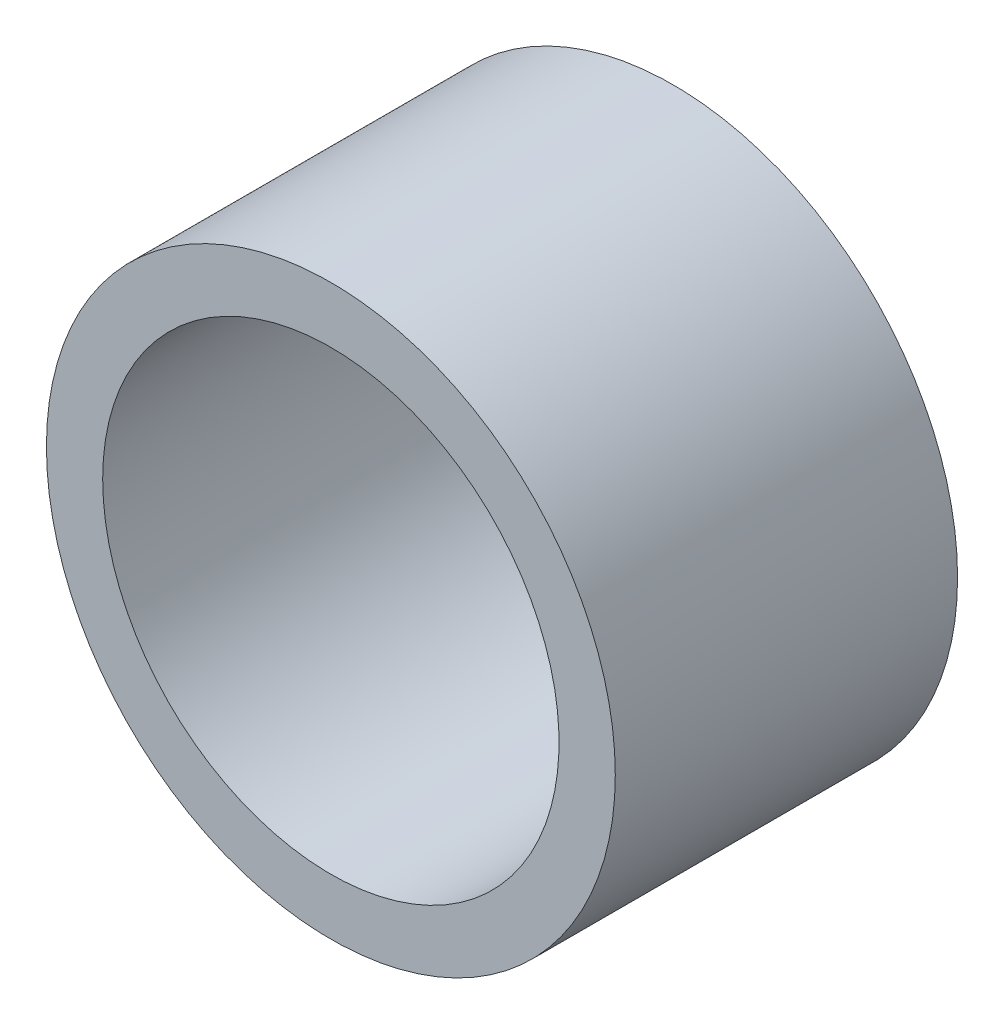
ISO-10303-21;
HEADER;
FILE_DESCRIPTION(('STEP AP214'),'2;1');
FILE_NAME('part.step','',(''),(''),'','','');
FILE_SCHEMA(('AUTOMOTIVE_DESIGN { 1 0 10303 214 1 1 1 1 }'));
ENDSEC;
DATA;
#1=APPLICATION_CONTEXT('core data for automotive mechanical design processes');
#2=APPLICATION_PROTOCOL_DEFINITION('international standard','automotive_design',2000,#1);
#3=PRODUCT_CONTEXT('',#1,'mechanical');
#4=PRODUCT('Part','Part','',(#3));
#5=PRODUCT_RELATED_PRODUCT_CATEGORY('part','',(#4));
#6=PRODUCT_DEFINITION_FORMATION('','',#4);
#7=PRODUCT_DEFINITION_CONTEXT('part definition',#1,'design');
#8=PRODUCT_DEFINITION('design','',#6,#7);
#9=PRODUCT_DEFINITION_SHAPE('','',#8);
#10=(LENGTH_UNIT() NAMED_UNIT(*) SI_UNIT(.MILLI.,.METRE.));
#11=(NAMED_UNIT(*) PLANE_ANGLE_UNIT() SI_UNIT($,.RADIAN.));
#12=(NAMED_UNIT(*) SI_UNIT($,.STERADIAN.) SOLID_ANGLE_UNIT());
#13=UNCERTAINTY_MEASURE_WITH_UNIT(LENGTH_MEASURE(1.E-05),#10,'distance_accuracy_value','');
#14=(GEOMETRIC_REPRESENTATION_CONTEXT(3) GLOBAL_UNCERTAINTY_ASSIGNED_CONTEXT((#13)) GLOBAL_UNIT_ASSIGNED_CONTEXT((#10,
#11,#12)) REPRESENTATION_CONTEXT('',''));
#15=CARTESIAN_POINT('',(0.,0.,0.));
#16=DIRECTION('',(0.,0.,1.));
#17=DIRECTION('',(1.,0.,0.));
#18=AXIS2_PLACEMENT_3D('',#15,#16,#17);
#19=CARTESIAN_POINT('',(0.,0.,38.1));
#20=DIRECTION('',(0.,0.,1.));
#21=DIRECTION('',(1.,0.,0.));
#22=AXIS2_PLACEMENT_3D('',#19,#20,#21);
#23=PLANE('',#22);
#24=CARTESIAN_POINT('',(0.,0.,38.1));
#25=DIRECTION('',(0.,0.,1.));
#26=DIRECTION('',(1.,0.,0.));
#27=AXIS2_PLACEMENT_3D('',#24,#25,#26);
#28=CIRCLE('',#27,31.6611);
#29=CARTESIAN_POINT('',(-31.6611,0.,38.1));
#30=VERTEX_POINT('',#29);
#31=EDGE_CURVE('E10',#30,#30,#28,.T.);
#32=ORIENTED_EDGE('',*,*,#31,.T.);
#33=EDGE_LOOP('',(#32));
#34=FACE_BOUND('',#33,.T.);
#35=CARTESIAN_POINT('',(0.,0.,38.1));
#36=DIRECTION('',(0.,0.,1.));
#37=DIRECTION('',(1.,0.,0.));
#38=AXIS2_PLACEMENT_3D('',#35,#36,#37);
#39=CIRCLE('',#38,25.4);
#40=CARTESIAN_POINT('',(-25.4,0.,38.1));
#41=VERTEX_POINT('',#40);
#42=EDGE_CURVE('E39',#41,#41,#39,.T.);
#43=ORIENTED_EDGE('',*,*,#42,.F.);
#44=EDGE_LOOP('',(#43));
#45=FACE_BOUND('',#44,.T.);
#46=ADVANCED_FACE('F28',(#34,#45),#23,.T.);
#47=CARTESIAN_POINT('',(0.,0.,0.));
#48=DIRECTION('',(0.,0.,1.));
#49=DIRECTION('',(1.,0.,0.));
#50=AXIS2_PLACEMENT_3D('',#47,#48,#49);
#51=PLANE('',#50);
#52=CARTESIAN_POINT('',(0.,0.,0.));
#53=DIRECTION('',(0.,0.,1.));
#54=DIRECTION('',(1.,0.,0.));
#55=AXIS2_PLACEMENT_3D('',#52,#53,#54);
#56=CIRCLE('',#55,31.6611);
#57=CARTESIAN_POINT('',(-31.6611,0.,0.));
#58=VERTEX_POINT('',#57);
#59=EDGE_CURVE('E35',#58,#58,#56,.T.);
#60=ORIENTED_EDGE('',*,*,#59,.F.);
#61=EDGE_LOOP('',(#60));
#62=FACE_BOUND('',#61,.T.);
#63=CARTESIAN_POINT('',(0.,0.,0.));
#64=DIRECTION('',(0.,0.,1.));
#65=DIRECTION('',(1.,0.,0.));
#66=AXIS2_PLACEMENT_3D('',#63,#64,#65);
#67=CIRCLE('',#66,25.4);
#68=CARTESIAN_POINT('',(-25.4,0.,0.));
#69=VERTEX_POINT('',#68);
#70=EDGE_CURVE('E43',#69,#69,#67,.T.);
#71=ORIENTED_EDGE('',*,*,#70,.T.);
#72=EDGE_LOOP('',(#71));
#73=FACE_BOUND('',#72,.T.);
#74=ADVANCED_FACE('F49',(#62,#73),#51,.F.);
#75=CARTESIAN_POINT('',(0.,0.,38.1));
#76=DIRECTION('',(0.,0.,-1.));
#77=DIRECTION('',(-1.,0.,0.));
#78=AXIS2_PLACEMENT_3D('',#75,#76,#77);
#79=CYLINDRICAL_SURFACE('',#78,31.6611);
#80=CARTESIAN_POINT('',(-31.6611,0.,38.1));
#81=CARTESIAN_POINT('',(-31.6611,0.,37.703125));
#82=CARTESIAN_POINT('',(-31.6611,0.,37.30625));
#83=CARTESIAN_POINT('',(-31.6611,0.,36.5125));
#84=CARTESIAN_POINT('',(-31.6611,0.,36.115625));
#85=CARTESIAN_POINT('',(-31.6611,0.,35.321875));
#86=CARTESIAN_POINT('',(-31.6611,0.,34.925));
#87=CARTESIAN_POINT('',(-31.6611,0.,34.13125));
#88=CARTESIAN_POINT('',(-31.6611,0.,33.734375));
#89=CARTESIAN_POINT('',(-31.6611,0.,32.940625));
#90=CARTESIAN_POINT('',(-31.6611,0.,32.54375));
#91=CARTESIAN_POINT('',(-31.6611,0.,31.75));
#92=CARTESIAN_POINT('',(-31.6611,0.,31.353125));
#93=CARTESIAN_POINT('',(-31.6611,0.,30.559375));
#94=CARTESIAN_POINT('',(-31.6611,0.,30.1625));
#95=CARTESIAN_POINT('',(-31.6611,0.,29.36875));
#96=CARTESIAN_POINT('',(-31.6611,0.,28.971875));
#97=CARTESIAN_POINT('',(-31.6611,0.,28.178125));
#98=CARTESIAN_POINT('',(-31.6611,0.,27.78125));
#99=CARTESIAN_POINT('',(-31.6611,0.,26.9875));
#100=CARTESIAN_POINT('',(-31.6611,0.,26.590625));
#101=CARTESIAN_POINT('',(-31.6611,0.,25.796875));
#102=CARTESIAN_POINT('',(-31.6611,0.,25.4));
#103=CARTESIAN_POINT('',(-31.6611,0.,24.60625));
#104=CARTESIAN_POINT('',(-31.6611,0.,24.209375));
#105=CARTESIAN_POINT('',(-31.6611,0.,23.415625));
#106=CARTESIAN_POINT('',(-31.6611,0.,23.01875));
#107=CARTESIAN_POINT('',(-31.6611,0.,22.225));
#108=CARTESIAN_POINT('',(-31.6611,0.,21.828125));
#109=CARTESIAN_POINT('',(-31.6611,0.,21.034375));
#110=CARTESIAN_POINT('',(-31.6611,0.,20.6375));
#111=CARTESIAN_POINT('',(-31.6611,0.,19.84375));
#112=CARTESIAN_POINT('',(-31.6611,0.,19.446875));
#113=CARTESIAN_POINT('',(-31.6611,0.,18.653125));
#114=CARTESIAN_POINT('',(-31.6611,0.,18.25625));
#115=CARTESIAN_POINT('',(-31.6611,0.,17.4625));
#116=CARTESIAN_POINT('',(-31.6611,0.,17.065625));
#117=CARTESIAN_POINT('',(-31.6611,0.,16.271875));
#118=CARTESIAN_POINT('',(-31.6611,0.,15.875));
#119=CARTESIAN_POINT('',(-31.6611,0.,15.08125));
#120=CARTESIAN_POINT('',(-31.6611,0.,14.684375));
#121=CARTESIAN_POINT('',(-31.6611,0.,13.890625));
#122=CARTESIAN_POINT('',(-31.6611,0.,13.49375));
#123=CARTESIAN_POINT('',(-31.6611,0.,12.7));
#124=CARTESIAN_POINT('',(-31.6611,0.,12.303125));
#125=CARTESIAN_POINT('',(-31.6611,0.,11.509375));
#126=CARTESIAN_POINT('',(-31.6611,0.,11.1125));
#127=CARTESIAN_POINT('',(-31.6611,0.,10.31875));
#128=CARTESIAN_POINT('',(-31.6611,0.,9.92187499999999));
#129=CARTESIAN_POINT('',(-31.6611,0.,9.128125));
#130=CARTESIAN_POINT('',(-31.6611,0.,8.73124999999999));
#131=CARTESIAN_POINT('',(-31.6611,0.,7.93749999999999));
#132=CARTESIAN_POINT('',(-31.6611,0.,7.54062499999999));
#133=CARTESIAN_POINT('',(-31.6611,0.,6.746875));
#134=CARTESIAN_POINT('',(-31.6611,0.,6.35));
#135=CARTESIAN_POINT('',(-31.6611,0.,5.55625));
#136=CARTESIAN_POINT('',(-31.6611,0.,5.159375));
#137=CARTESIAN_POINT('',(-31.6611,0.,4.365625));
#138=CARTESIAN_POINT('',(-31.6611,0.,3.96875));
#139=CARTESIAN_POINT('',(-31.6611,0.,3.175));
#140=CARTESIAN_POINT('',(-31.6611,0.,2.778125));
#141=CARTESIAN_POINT('',(-31.6611,0.,1.984375));
#142=CARTESIAN_POINT('',(-31.6611,0.,1.5875));
#143=CARTESIAN_POINT('',(-31.6611,0.,0.79375));
#144=CARTESIAN_POINT('',(-31.6611,0.,0.396875));
#145=CARTESIAN_POINT('',(-31.6611,0.,0.));
#146=B_SPLINE_CURVE_WITH_KNOTS('',3,(#80,#81,#82,#83,#84,#85,#86,#87,#88,#89,#90,#91,#92,#93,
#94,#95,#96,#97,#98,#99,#100,#101,#102,#103,#104,#105,#106,#107,#108,#109,#110,#111,#112,#113,
#114,#115,#116,#117,#118,#119,#120,#121,#122,#123,#124,#125,#126,#127,#128,#129,#130,#131,#132,
#133,#134,#135,#136,#137,#138,#139,#140,#141,#142,#143,#144,#145),.UNSPECIFIED.,.F.,.F.,(4,2,2,
2,2,2,2,2,2,2,2,2,2,2,2,2,2,2,2,2,2,2,2,2,2,2,2,2,2,2,2,2,4),(0.,1.190625,2.38125,3.571875,
4.7625,5.953125,7.14375,8.334375,9.52500000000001,10.715625,11.90625,13.096875,14.2875,
15.478125,16.66875,17.859375,19.05,20.240625,21.43125,22.621875,23.8125,25.003125,26.19375,
27.384375,28.575,29.765625,30.95625,32.146875,33.3375,34.528125,35.71875,36.909375,38.1),.UNSPECIFIED.);
#147=EDGE_CURVE('BSEAM30',#30,#58,#146,.T.);
#148=ORIENTED_EDGE('',*,*,#31,.F.);
#149=ORIENTED_EDGE('',*,*,#59,.T.);
#150=ORIENTED_EDGE('',*,*,#147,.T.);
#151=ORIENTED_EDGE('',*,*,#147,.F.);
#152=EDGE_LOOP('',(#148,#150,#149,#151));
#153=FACE_BOUND('',#152,.T.);
#154=ADVANCED_FACE('F30',(#153),#79,.T.);
#155=CARTESIAN_POINT('',(0.,0.,38.1));
#156=DIRECTION('',(0.,0.,-1.));
#157=DIRECTION('',(-1.,0.,0.));
#158=AXIS2_PLACEMENT_3D('',#155,#156,#157);
#159=CYLINDRICAL_SURFACE('',#158,25.4);
#160=CARTESIAN_POINT('',(-25.4,0.,38.1));
#161=CARTESIAN_POINT('',(-25.4,0.,37.703125));
#162=CARTESIAN_POINT('',(-25.4,0.,37.30625));
#163=CARTESIAN_POINT('',(-25.4,0.,36.5125));
#164=CARTESIAN_POINT('',(-25.4,0.,36.115625));
#165=CARTESIAN_POINT('',(-25.4,0.,35.321875));
#166=CARTESIAN_POINT('',(-25.4,0.,34.925));
#167=CARTESIAN_POINT('',(-25.4,0.,34.13125));
#168=CARTESIAN_POINT('',(-25.4,0.,33.734375));
#169=CARTESIAN_POINT('',(-25.4,0.,32.940625));
#170=CARTESIAN_POINT('',(-25.4,0.,32.54375));
#171=CARTESIAN_POINT('',(-25.4,0.,31.75));
#172=CARTESIAN_POINT('',(-25.4,0.,31.353125));
#173=CARTESIAN_POINT('',(-25.4,0.,30.559375));
#174=CARTESIAN_POINT('',(-25.4,0.,30.1625));
#175=CARTESIAN_POINT('',(-25.4,0.,29.36875));
#176=CARTESIAN_POINT('',(-25.4,0.,28.971875));
#177=CARTESIAN_POINT('',(-25.4,0.,28.178125));
#178=CARTESIAN_POINT('',(-25.4,0.,27.78125));
#179=CARTESIAN_POINT('',(-25.4,0.,26.9875));
#180=CARTESIAN_POINT('',(-25.4,0.,26.590625));
#181=CARTESIAN_POINT('',(-25.4,0.,25.796875));
#182=CARTESIAN_POINT('',(-25.4,0.,25.4));
#183=CARTESIAN_POINT('',(-25.4,0.,24.60625));
#184=CARTESIAN_POINT('',(-25.4,0.,24.209375));
#185=CARTESIAN_POINT('',(-25.4,0.,23.415625));
#186=CARTESIAN_POINT('',(-25.4,0.,23.01875));
#187=CARTESIAN_POINT('',(-25.4,0.,22.225));
#188=CARTESIAN_POINT('',(-25.4,0.,21.828125));
#189=CARTESIAN_POINT('',(-25.4,0.,21.034375));
#190=CARTESIAN_POINT('',(-25.4,0.,20.6375));
#191=CARTESIAN_POINT('',(-25.4,0.,19.84375));
#192=CARTESIAN_POINT('',(-25.4,0.,19.446875));
#193=CARTESIAN_POINT('',(-25.4,0.,18.653125));
#194=CARTESIAN_POINT('',(-25.4,0.,18.25625));
#195=CARTESIAN_POINT('',(-25.4,0.,17.4625));
#196=CARTESIAN_POINT('',(-25.4,0.,17.065625));
#197=CARTESIAN_POINT('',(-25.4,0.,16.271875));
#198=CARTESIAN_POINT('',(-25.4,0.,15.875));
#199=CARTESIAN_POINT('',(-25.4,0.,15.08125));
#200=CARTESIAN_POINT('',(-25.4,0.,14.684375));
#201=CARTESIAN_POINT('',(-25.4,0.,13.890625));
#202=CARTESIAN_POINT('',(-25.4,0.,13.49375));
#203=CARTESIAN_POINT('',(-25.4,0.,12.7));
#204=CARTESIAN_POINT('',(-25.4,0.,12.303125));
#205=CARTESIAN_POINT('',(-25.4,0.,11.509375));
#206=CARTESIAN_POINT('',(-25.4,0.,11.1125));
#207=CARTESIAN_POINT('',(-25.4,0.,10.31875));
#208=CARTESIAN_POINT('',(-25.4,0.,9.921875));
#209=CARTESIAN_POINT('',(-25.4,0.,9.128125));
#210=CARTESIAN_POINT('',(-25.4,0.,8.73125));
#211=CARTESIAN_POINT('',(-25.4,0.,7.9375));
#212=CARTESIAN_POINT('',(-25.4,0.,7.540625));
#213=CARTESIAN_POINT('',(-25.4,0.,6.746875));
#214=CARTESIAN_POINT('',(-25.4,0.,6.35));
#215=CARTESIAN_POINT('',(-25.4,0.,5.55625));
#216=CARTESIAN_POINT('',(-25.4,0.,5.159375));
#217=CARTESIAN_POINT('',(-25.4,0.,4.365625));
#218=CARTESIAN_POINT('',(-25.4,0.,3.96875));
#219=CARTESIAN_POINT('',(-25.4,0.,3.175));
#220=CARTESIAN_POINT('',(-25.4,0.,2.778125));
#221=CARTESIAN_POINT('',(-25.4,0.,1.984375));
#222=CARTESIAN_POINT('',(-25.4,0.,1.5875));
#223=CARTESIAN_POINT('',(-25.4,0.,0.79375));
#224=CARTESIAN_POINT('',(-25.4,0.,0.396875));
#225=CARTESIAN_POINT('',(-25.4,0.,0.));
#226=B_SPLINE_CURVE_WITH_KNOTS('',3,(#160,#161,#162,#163,#164,#165,#166,#167,#168,#169,#170,
#171,#172,#173,#174,#175,#176,#177,#178,#179,#180,#181,#182,#183,#184,#185,#186,#187,#188,#189,
#190,#191,#192,#193,#194,#195,#196,#197,#198,#199,#200,#201,#202,#203,#204,#205,#206,#207,#208,
#209,#210,#211,#212,#213,#214,#215,#216,#217,#218,#219,#220,#221,#222,#223,#224,#225),
.UNSPECIFIED.,.F.,.F.,(4,2,2,2,2,2,2,2,2,2,2,2,2,2,2,2,2,2,2,2,2,2,2,2,2,2,2,2,2,2,2,2,4),(0.,
1.19062499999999,2.38124999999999,3.571875,4.7625,5.953125,7.14375,8.33437499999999,9.525,
10.715625,11.90625,13.096875,14.2875,15.478125,16.66875,17.859375,19.05,20.240625,21.43125,
22.621875,23.8125,25.003125,26.19375,27.384375,28.575,29.765625,30.95625,32.146875,33.3375,
34.528125,35.71875,36.909375,38.1),.UNSPECIFIED.);
#227=EDGE_CURVE('BSEAM51',#41,#69,#226,.T.);
#228=ORIENTED_EDGE('',*,*,#42,.T.);
#229=ORIENTED_EDGE('',*,*,#70,.F.);
#230=ORIENTED_EDGE('',*,*,#227,.T.);
#231=ORIENTED_EDGE('',*,*,#227,.F.);
#232=EDGE_LOOP('',(#228,#230,#229,#231));
#233=FACE_BOUND('',#232,.T.);
#234=ADVANCED_FACE('F51',(#233),#159,.F.);
#235=CLOSED_SHELL('',(#46,#74,#154,#234));
#236=MANIFOLD_SOLID_BREP('B2',#235);
#237=ADVANCED_BREP_SHAPE_REPRESENTATION('',(#18,#236),#14);
#238=SHAPE_DEFINITION_REPRESENTATION(#9,#237);
ENDSEC;
END-ISO-10303-21;
